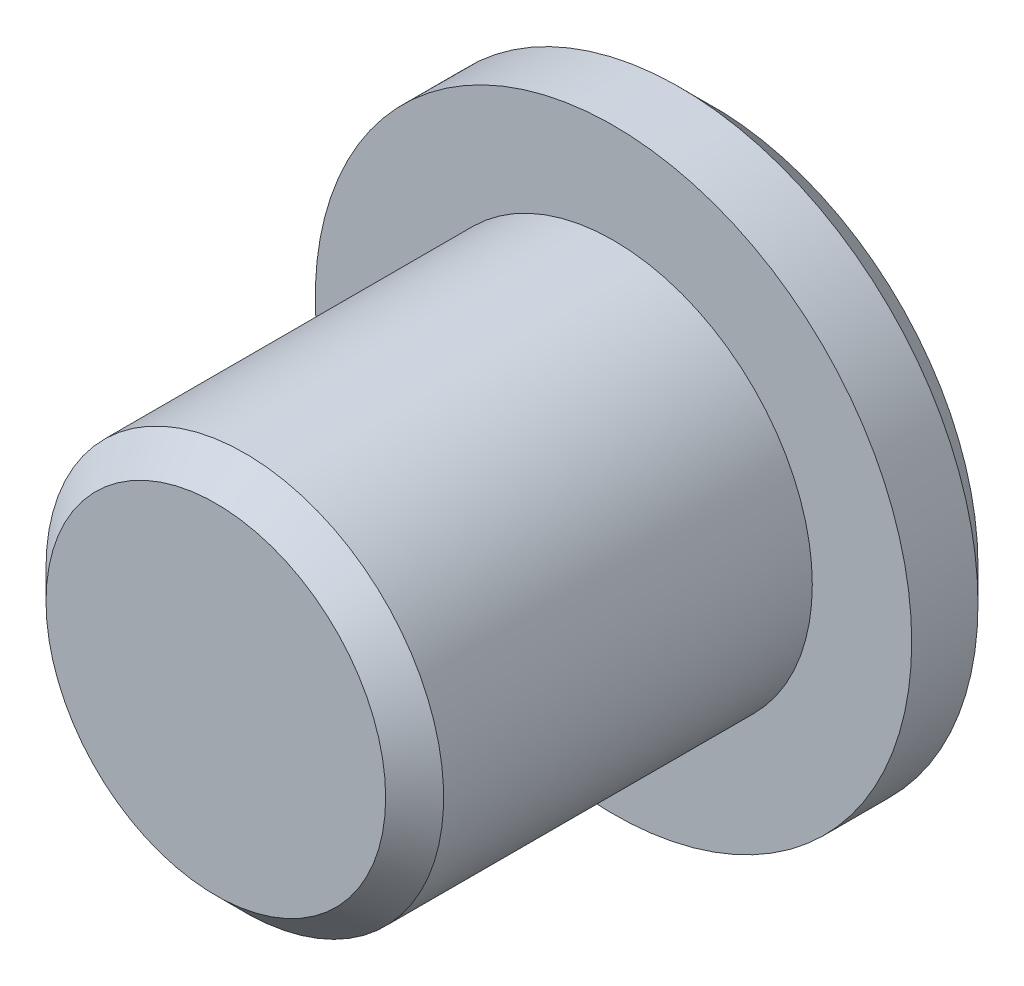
from build123d import *

# Parameters (mm, degrees)
ESQUISSE1_R                       = 9
EXTRUSION1_DEPTH                  = 3
ESQUISSE2_R                       = 6
EXTRUSION2_DEPTH                  = 12
CHANFREIN1_SIZE                   = 0.875
CHANFREIN2_SIZE                   = 1
DIAM_TRE_DU_PER_AGE_6_0_6_1_D     = 6
DIAM_TRE_DU_PER_AGE_6_0_6_1_DEPTH = 6
DIAM_TRE_DU_PER_AGE_6_0_6_1_TIP   = 1.802581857
EXTRUSION3_DEPTH                  = 6


with BuildPart() as part:
    # Esquisse1 → Extrusion1 (new body)
    with BuildSketch(Plane.XY):
        Circle(ESQUISSE1_R)
    extrude(amount=EXTRUSION1_DEPTH)

    # Esquisse2 → Extrusion2 (add)
    with BuildSketch(Plane.XY.offset(3)):
        Circle(ESQUISSE2_R)
    extrude(amount=EXTRUSION2_DEPTH)

    # Chanfrein1
    chanfrein1_edges = [part.edges().sort_by_distance(p)[0] for p in [
        (-6, 0, 15),
    ]]
    chamfer(chanfrein1_edges, length=CHANFREIN1_SIZE)

    # Chanfrein2
    chanfrein2_edges = [part.edges().sort_by_distance(p)[0] for p in [
        (-9, 0, 0),
    ]]
    chamfer(chanfrein2_edges, length=CHANFREIN2_SIZE)

    # Diam_tre du per_age _6.0 _6_1
    with Locations(Plane(origin=(0, 0, 0), x_dir=(-1, 0, 0), z_dir=(0, 0, -1))):
        with Locations((0, 0)):
            Hole(DIAM_TRE_DU_PER_AGE_6_0_6_1_D / 2, depth=DIAM_TRE_DU_PER_AGE_6_0_6_1_DEPTH)
            with Locations((0, 0, -(DIAM_TRE_DU_PER_AGE_6_0_6_1_DEPTH + DIAM_TRE_DU_PER_AGE_6_0_6_1_TIP / 2))):  # 118° drill point
                Cone(0, DIAM_TRE_DU_PER_AGE_6_0_6_1_D / 2, DIAM_TRE_DU_PER_AGE_6_0_6_1_TIP, mode=Mode.SUBTRACT)

    # Esquisse5 → Extrusion3 (cut)
    with BuildSketch(Plane(origin=(0, 0, 0), x_dir=(-1, 0, 0), z_dir=(0, 0, -1))):
        Polygon((1.732050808, 3), (-1.732050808, 3), (-3.464101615, 0), (-1.732050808, -3), (1.732050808, -3), (3.464101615, 0), align=None)
    extrude(amount=-EXTRUSION3_DEPTH, mode=Mode.SUBTRACT)

    # Esquisse7 → Enl_vement de mati_re-R_volution1 (revolve, cut)
    with BuildSketch(Plane(origin=(0, 0, 0), x_dir=(1, 0, 0), z_dir=(0, 1, 0)), mode=Mode.PRIVATE) as enl_vement_de_mati_re_r_volution1_sk:
        Polygon((3.464101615, 0), (0, 0), (0, -3.464101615), align=None)
    revolve(enl_vement_de_mati_re_r_volution1_sk.sketch.rotate(Axis((0, 0, 0), (0, 0, 1)), 180), axis=Axis((0, 0, 0), (0, 0, 1)), mode=Mode.SUBTRACT)


solid = part.part
